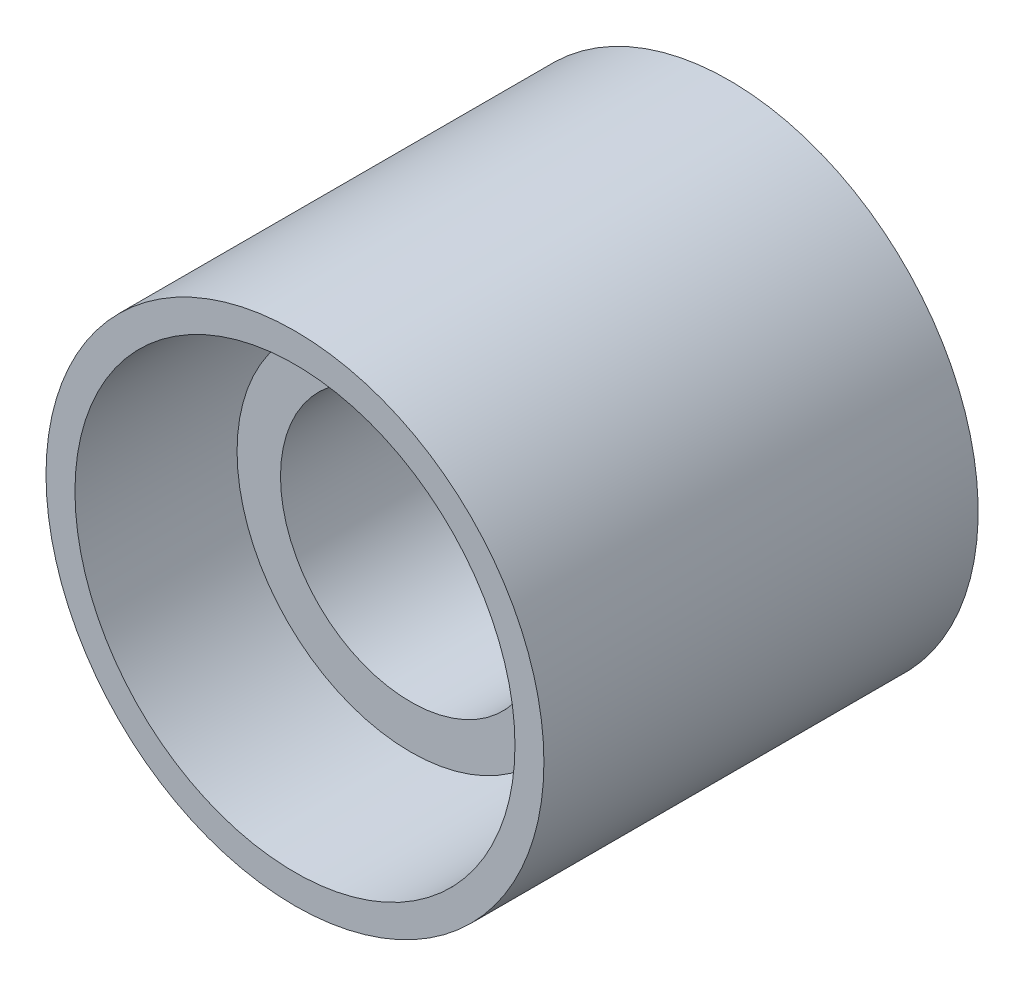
from build123d import *

# Parameters (mm, degrees)
SKETCH_1_R          = 43
SKETCH_1_R_2        = 38
EXTRUDE_1_DEPTH     = 40
SKETCH_2_R          = 30
EXTRUDE_2_DEPTH     = 20
EXTRUDE_START       = 35
SKETCH_3_R          = 43
EXTRUDE_3_DEPTH     = 35
SKETCH_4_R          = 22.5
CUT_EXTRUDE_1_DEPTH = 97.555683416


with BuildPart() as part:
    # Sketch 1 → Extrude 1 (new body)
    with BuildSketch(Plane.XY):
        Circle(SKETCH_1_R)
        Circle(SKETCH_1_R_2, mode=Mode.SUBTRACT)
    extrude(amount=EXTRUDE_1_DEPTH)



with BuildPart() as body_2:
    # Sketch 2 → Extrude 2 (new body)
    with BuildSketch(Plane(origin=(0, 0, 0), x_dir=(-1, 0, 0), z_dir=(0, 0, -1))):
        Circle(SKETCH_2_R)
    extrude(amount=-EXTRUDE_2_DEPTH)


with BuildPart() as part_1:
    add(part.part)

    add(body_2.part)  # Extrude 3 merges body 2
    # Sketch 3 → Extrude 3 (add)
    with BuildSketch(Plane(origin=(0, 0, 0), x_dir=(-1, 0, 0), z_dir=(0, 0, -1)).offset(EXTRUDE_START)):
        Circle(SKETCH_3_R)
    extrude(amount=-EXTRUDE_3_DEPTH)

    # Sketch 4 → Cut-Extrude 1 (cut, through all)
    with BuildSketch(Plane(origin=(0, 0, -35), x_dir=(-1, 0, 0), z_dir=(0, 0, -1))):
        Circle(SKETCH_4_R)
    extrude(amount=-CUT_EXTRUDE_1_DEPTH, mode=Mode.SUBTRACT)


solid = part_1.part
